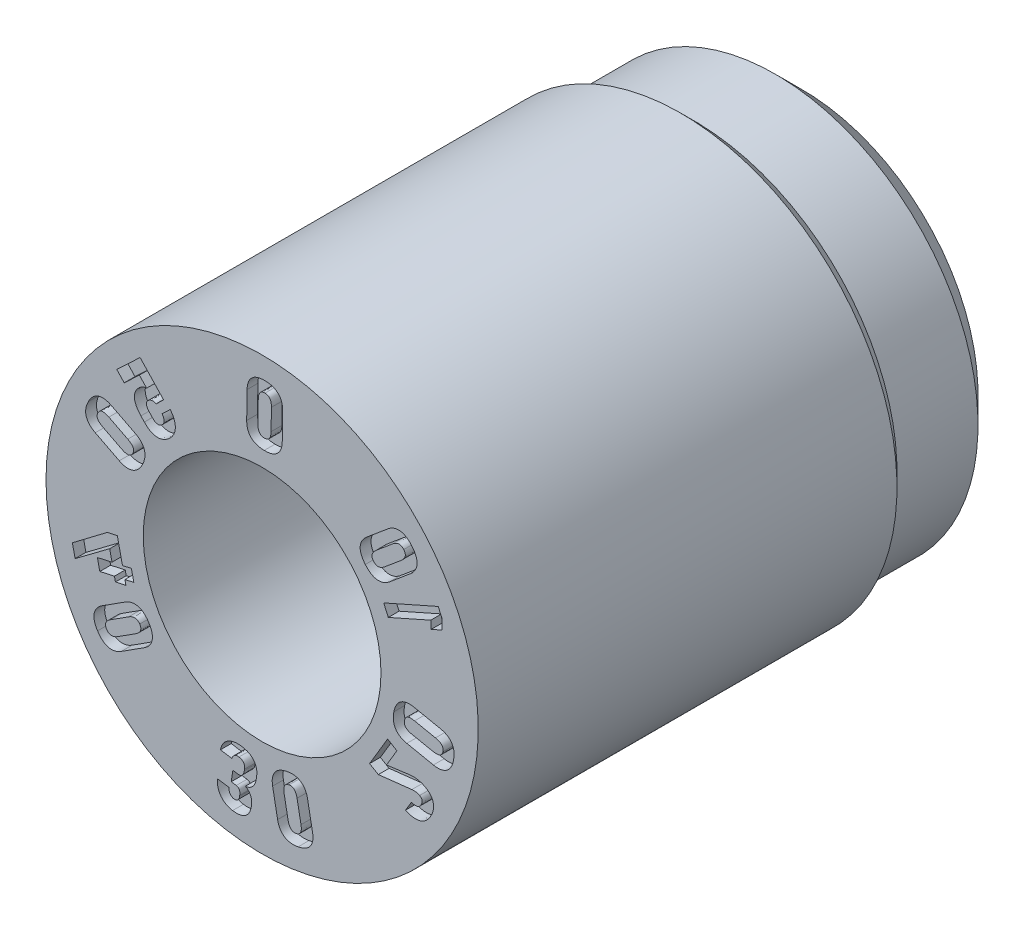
from build123d import *

# Parameters (mm, degrees)
CUT_EXTRUDE1_DEPTH = 0.2


with BuildPart() as part:
    # Sketch2 → Revolve1 (revolve)
    with BuildSketch(Plane(origin=(0, 0, 0), x_dir=(1, 0, 0), z_dir=(0, 1, 0)), mode=Mode.PRIVATE) as revolve1_sk:
        Polygon((3.249621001, 10), (1.15, 10), (1.15, 7.468), (2.2, 7.468), (2.2, 0), (4, 0), (4, 7.75), (3.75, 8), (3.75, 9.499621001), align=None)
    revolve(revolve1_sk.sketch.rotate(Axis((0, 0, -4.849143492), (0, 0, 1)), 180), axis=Axis((0, 0, -4.849143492), (0, 0, 1)))

    # Sketch7 → Cut-Extrude1 (cut)
    # profile 1 of 11: a face of its own
    with BuildSketch(Plane.XY):
        with BuildLine():
            Line((0.372515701, 2.796139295), (0.380015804, 3.296266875))
            add(Edge.make_bspline(
                [(0.380015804, 3.296266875), (0.38043238, 3.319673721), (0.378773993, 3.354103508), (0.370234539, 3.398086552), (0.361653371, 3.428335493), (0.350089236, 3.456399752), (0.336011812, 3.482461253), (0.319112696, 3.506441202), (0.299609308, 3.528409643), (0.277402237, 3.547964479), (0.252928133, 3.565185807), (0.225938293, 3.579864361), (0.196404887, 3.591530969), (0.164622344, 3.601183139), (0.117629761, 3.61036973), (0.080835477, 3.61346309), (0.055588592, 3.613705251)],
                knots=[0, 0, 0, 0, 0.135916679, 0.199020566, 0.259617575, 0.318028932, 0.374760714, 0.431118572, 0.487850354, 0.544800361, 0.602395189, 0.661140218, 0.722587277, 0.786313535, 0.853593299, 1, 1, 1, 1], degree=3))
            add(Edge.make_bspline(
                [(0.055588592, 3.613705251), (0.030232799, 3.614238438), (-0.006797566, 3.612489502), (-0.054133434, 3.604485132), (-0.08621242, 3.595998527), (-0.116076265, 3.585211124), (-0.143392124, 3.571228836), (-0.168487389, 3.555046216), (-0.190946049, 3.536019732), (-0.210915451, 3.514755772), (-0.228702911, 3.491478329), (-0.243292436, 3.465618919), (-0.255683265, 3.437871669), (-0.265328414, 3.407932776), (-0.274813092, 3.364063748), (-0.278088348, 3.32969752), (-0.278152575, 3.306150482)],
                knots=[0, 0, 0, 0, 0.147071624, 0.214293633, 0.278046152, 0.339282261, 0.398039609, 0.455620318, 0.512083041, 0.56825736, 0.624525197, 0.681520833, 0.740021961, 0.800497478, 0.863558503, 1, 1, 1, 1], degree=3))
            Line((-0.278152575, 3.306150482), (-0.285652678, 2.806022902))
            add(Edge.make_bspline(
                [(-0.285652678, 2.806022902), (-0.286080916, 2.782612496), (-0.284389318, 2.748192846), (-0.27591428, 2.704264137), (-0.267228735, 2.674122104), (-0.255708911, 2.646004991), (-0.24145371, 2.619921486), (-0.224533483, 2.595837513), (-0.205020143, 2.573873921), (-0.182814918, 2.554319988), (-0.158343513, 2.537090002), (-0.131402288, 2.52247991), (-0.101924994, 2.510662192), (-0.070164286, 2.501177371), (-0.023209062, 2.491848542), (0.013536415, 2.488862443), (0.038774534, 2.488584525)],
                knots=[0, 0, 0, 0, 0.135948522, 0.199067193, 0.259265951, 0.317690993, 0.375029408, 0.431400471, 0.488145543, 0.545108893, 0.602717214, 0.661476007, 0.722530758, 0.786690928, 0.853558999, 1, 1, 1, 1], degree=3))
            add(Edge.make_bspline(
                [(0.038774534, 2.488584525), (0.064106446, 2.488176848), (0.101219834, 2.489570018), (0.148467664, 2.498119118), (0.180641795, 2.506430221), (0.210492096, 2.51762388), (0.237955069, 2.531575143), (0.262920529, 2.548301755), (0.285555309, 2.567311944), (0.305591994, 2.588803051), (0.322963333, 2.612494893), (0.338056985, 2.6380916), (0.349965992, 2.665998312), (0.359732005, 2.695615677), (0.369198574, 2.738973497), (0.372433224, 2.772889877), (0.372515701, 2.796139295)],
                knots=[0, 0, 0, 0, 0.147244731, 0.214633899, 0.278461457, 0.339933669, 0.39934914, 0.456893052, 0.514034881, 0.570600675, 0.627041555, 0.684310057, 0.742717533, 0.802847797, 0.86513064, 1, 1, 1, 1], degree=3))
        make_face()
        with BuildLine():
            Line((-0.077556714, 2.856153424), (-0.071516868, 3.250243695))
            add(Edge.make_bspline(
                [(-0.071516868, 3.250243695), (-0.071427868, 3.274045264), (-0.068011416, 3.307957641), (-0.054694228, 3.348731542), (-0.043327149, 3.369060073), (-0.032461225, 3.382612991), (-0.023515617, 3.391421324), (-0.013166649, 3.398505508), (-0.00207849, 3.404541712), (0.010216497, 3.408806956), (0.028313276, 3.413277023), (0.042761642, 3.414097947), (0.052598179, 3.413967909)],
                knots=[0, 0, 0, 0, 0.305303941, 0.432512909, 0.54730289, 0.60130705, 0.654799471, 0.707462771, 0.761500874, 0.816087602, 0.873697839, 1, 1, 1, 1], degree=3))
            add(Edge.make_bspline(
                [(0.052598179, 3.413967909), (0.062405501, 3.413784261), (0.076827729, 3.412488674), (0.094807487, 3.407526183), (0.107077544, 3.403092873), (0.117829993, 3.396444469), (0.127850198, 3.388975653), (0.136830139, 3.38013654), (0.147414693, 3.366233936), (0.157914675, 3.345425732), (0.170346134, 3.304398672), (0.17207795, 3.270309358), (0.171933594, 3.24658448)],
                knots=[0, 0, 0, 0, 0.125899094, 0.183939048, 0.238731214, 0.292280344, 0.345132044, 0.398638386, 0.453053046, 0.568333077, 0.694858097, 1, 1, 1, 1], degree=3))
            Line((0.171933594, 3.24658448), (0.165893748, 2.852494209))
            add(Edge.make_bspline(
                [(0.165893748, 2.852494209), (0.165895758, 2.8286767), (0.16223851, 2.794828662), (0.149246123, 2.753952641), (0.138055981, 2.733364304), (0.126817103, 2.719970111), (0.117896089, 2.711087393), (0.107540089, 2.703992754), (0.096398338, 2.698028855), (0.084201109, 2.693415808), (0.066029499, 2.689068), (0.051612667, 2.68816147), (0.041764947, 2.688321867)],
                knots=[0, 0, 0, 0, 0.304842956, 0.431582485, 0.547045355, 0.601549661, 0.654961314, 0.707545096, 0.761501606, 0.816365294, 0.873888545, 1, 1, 1, 1], degree=3))
            add(Edge.make_bspline(
                [(0.041764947, 2.688321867), (0.031953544, 2.688509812), (0.017615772, 2.689786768), (-0.000407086, 2.694756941), (-0.012528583, 2.699478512), (-0.023603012, 2.705774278), (-0.033394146, 2.713506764), (-0.042244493, 2.722432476), (-0.052840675, 2.736260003), (-0.063310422, 2.757186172), (-0.076103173, 2.798196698), (-0.077618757, 2.83245604), (-0.077556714, 2.856153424)],
                knots=[0, 0, 0, 0, 0.125783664, 0.182840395, 0.238804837, 0.291849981, 0.345213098, 0.397973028, 0.452337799, 0.567512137, 0.695137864, 1, 1, 1, 1], degree=3))
        make_face(mode=Mode.SUBTRACT)
    # profile 2 of 11: a face of its own
    with BuildSketch(Plane.XY):
        with BuildLine():
            Line((2.361206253, 1.544277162), (2.745359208, 1.865868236))
            add(Edge.make_bspline(
                [(2.745359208, 1.865868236), (2.763356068, 1.880903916), (2.788412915, 1.904583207), (2.816076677, 1.939841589), (2.833229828, 1.966142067), (2.847034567, 1.993202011), (2.857676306, 2.020911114), (2.864482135, 2.0495183), (2.868429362, 2.07867086), (2.869006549, 2.108340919), (2.865775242, 2.138213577), (2.859295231, 2.168295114), (2.849012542, 2.198426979), (2.835507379, 2.228710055), (2.811917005, 2.270383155), (2.790072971, 2.300135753), (2.773782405, 2.319467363)],
                knots=[0, 0, 0, 0, 0.136048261, 0.198821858, 0.259388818, 0.3177557, 0.374583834, 0.430992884, 0.487788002, 0.544820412, 0.602526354, 0.661561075, 0.722810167, 0.786716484, 0.853482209, 1, 1, 1, 1], degree=3))
            add(Edge.make_bspline(
                [(2.773782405, 2.319467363), (2.75749871, 2.338980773), (2.732005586, 2.365983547), (2.69495357, 2.396676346), (2.667683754, 2.415706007), (2.639567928, 2.430657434), (2.611415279, 2.442903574), (2.582534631, 2.450922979), (2.553455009, 2.455752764), (2.524190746, 2.45712116), (2.49491693, 2.455051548), (2.465785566, 2.449421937), (2.436683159, 2.4407025), (2.407712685, 2.428348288), (2.368036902, 2.407155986), (2.340270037, 2.386407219), (2.322138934, 2.371453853)],
                knots=[0, 0, 0, 0, 0.147180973, 0.214193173, 0.278272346, 0.339279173, 0.398254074, 0.455627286, 0.512298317, 0.56858008, 0.624811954, 0.681767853, 0.739995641, 0.800344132, 0.863777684, 1, 1, 1, 1], degree=3))
            Line((2.322138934, 2.371453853), (1.937985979, 2.049862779))
            add(Edge.make_bspline(
                [(1.937985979, 2.049862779), (1.919988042, 2.03482741), (1.894934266, 2.011147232), (1.867265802, 1.975890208), (1.85012499, 1.949586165), (1.836242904, 1.922473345), (1.825742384, 1.894640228), (1.818517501, 1.866057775), (1.814685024, 1.83687409), (1.814048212, 1.807279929), (1.817387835, 1.777488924), (1.823819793, 1.74747328), (1.834126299, 1.717350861), (1.847586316, 1.686988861), (1.871553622, 1.645473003), (1.893188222, 1.615547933), (1.909562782, 1.596263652)],
                knots=[0, 0, 0, 0, 0.136005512, 0.198759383, 0.259307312, 0.317655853, 0.374891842, 0.431311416, 0.488088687, 0.545103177, 0.60237518, 0.661391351, 0.722621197, 0.786507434, 0.853528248, 1, 1, 1, 1], degree=3))
            add(Edge.make_bspline(
                [(1.909562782, 1.596263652), (1.925768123, 1.576822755), (1.95123474, 1.549834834), (1.988396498, 1.519331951), (2.015706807, 1.500266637), (2.043829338, 1.485172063), (2.0722147, 1.473351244), (2.101163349, 1.46510032), (2.130467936, 1.46059458), (2.159916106, 1.459328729), (2.189327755, 1.461764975), (2.218582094, 1.467183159), (2.247633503, 1.475974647), (2.276461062, 1.488122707), (2.31569609, 1.509136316), (2.343383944, 1.529331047), (2.361206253, 1.544277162)],
                knots=[0, 0, 0, 0, 0.146754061, 0.214223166, 0.27837807, 0.339456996, 0.398831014, 0.456272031, 0.513451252, 0.570286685, 0.626693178, 0.684121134, 0.742417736, 0.802238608, 0.865138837, 1, 1, 1, 1], degree=3))
        make_face()
        with BuildLine():
            Line((2.112064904, 1.924752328), (2.414715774, 2.178081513))
            add(Edge.make_bspline(
                [(2.414715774, 2.178081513), (2.433163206, 2.192979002), (2.46061737, 2.213376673), (2.500362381, 2.229753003), (2.527372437, 2.235455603), (2.553390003, 2.234770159), (2.58763726, 2.223905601), (2.608556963, 2.205255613), (2.620425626, 2.191004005)],
                knots=[0, 0, 0, 0, 0.304434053, 0.43191662, 0.54686507, 0.654939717, 0.760865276, 1, 1, 1, 1], degree=3))
            add(Edge.make_bspline(
                [(2.620425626, 2.191004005), (2.626554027, 2.183349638), (2.635234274, 2.171782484), (2.643204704, 2.154831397), (2.647441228, 2.142495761), (2.649817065, 2.130015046), (2.650522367, 2.117559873), (2.649730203, 2.104994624), (2.645894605, 2.087971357), (2.637014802, 2.066352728), (2.614246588, 2.029893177), (2.589279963, 2.006417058), (2.571280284, 1.990978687)],
                knots=[0, 0, 0, 0, 0.125814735, 0.183364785, 0.23896944, 0.292216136, 0.345299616, 0.398176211, 0.452685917, 0.567770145, 0.695197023, 1, 1, 1, 1], degree=3))
            Line((2.571280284, 1.990978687), (2.268629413, 1.737649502))
            add(Edge.make_bspline(
                [(2.268629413, 1.737649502), (2.250153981, 1.722814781), (2.222723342, 1.702210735), (2.182806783, 1.686059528), (2.15583733, 1.680351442), (2.129843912, 1.680887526), (2.095942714, 1.692273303), (2.074827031, 1.710259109), (2.063140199, 1.724687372)],
                knots=[0, 0, 0, 0, 0.304816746, 0.433270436, 0.548363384, 0.655627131, 0.761810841, 1, 1, 1, 1], degree=3))
            add(Edge.make_bspline(
                [(2.063140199, 1.724687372), (2.05692335, 1.732297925), (2.048467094, 1.744024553), (2.040106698, 1.760832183), (2.03589515, 1.773240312), (2.033601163, 1.785737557), (2.032524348, 1.798187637), (2.033414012, 1.810778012), (2.037223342, 1.827794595), (2.046069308, 1.849478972), (2.069273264, 1.885693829), (2.093948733, 1.90938844), (2.112064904, 1.924752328)],
                knots=[0, 0, 0, 0, 0.125670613, 0.183714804, 0.239255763, 0.292441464, 0.34569566, 0.398511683, 0.452958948, 0.567911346, 0.695546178, 1, 1, 1, 1], degree=3))
        make_face(mode=Mode.SUBTRACT)
    # profile 3 of 11: a face of its own
    with BuildSketch(Plane.XY):
        Polygon((2.250753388, 1.150243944), (2.335097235, 0.959973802), (3.12052075, 1.308595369), (3.128650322, 1.165370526), (3.330558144, 1.254913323), (3.331462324, 1.435582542), (3.259492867, 1.598075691), align=None)
    # profile 4 of 11: a face of its own
    with BuildSketch(Plane.XY):
        with BuildLine():
            Line((2.67852513, -0.886818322), (3.169385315, -0.987816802))
            add(Edge.make_bspline(
                [(3.169385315, -0.987816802), (3.192361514, -0.992542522), (3.226528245, -0.997415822), (3.271367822, -0.997006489), (3.302651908, -0.994345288), (3.332459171, -0.988013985), (3.360778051, -0.979003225), (3.387650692, -0.966940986), (3.412766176, -0.951695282), (3.436121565, -0.933639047), (3.457644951, -0.912785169), (3.477109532, -0.889063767), (3.494306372, -0.862311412), (3.509678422, -0.832813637), (3.52754177, -0.788247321), (3.537220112, -0.752500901), (3.542391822, -0.727766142)],
                knots=[0, 0, 0, 0, 0.136056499, 0.198872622, 0.259510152, 0.317640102, 0.375023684, 0.431403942, 0.487870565, 0.544847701, 0.602093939, 0.661145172, 0.722212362, 0.78603048, 0.853579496, 1, 1, 1, 1], degree=3))
            add(Edge.make_bspline(
                [(3.542391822, -0.727766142), (3.547225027, -0.702905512), (3.553026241, -0.666225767), (3.553826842, -0.618150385), (3.551450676, -0.584939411), (3.546111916, -0.553571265), (3.538056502, -0.523902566), (3.526607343, -0.496204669), (3.512175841, -0.470412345), (3.495010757, -0.446680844), (3.475133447, -0.425064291), (3.45261875, -0.405743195), (3.42765231, -0.388333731), (3.399938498, -0.373426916), (3.358559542, -0.355763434), (3.325204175, -0.346388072), (3.302065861, -0.341754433)],
                knots=[0, 0, 0, 0, 0.146740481, 0.214033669, 0.277858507, 0.339150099, 0.39790425, 0.455392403, 0.512130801, 0.568566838, 0.624503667, 0.681668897, 0.739930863, 0.800300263, 0.863434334, 1, 1, 1, 1], degree=3))
            Line((3.302065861, -0.341754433), (2.811205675, -0.240755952))
            add(Edge.make_bspline(
                [(2.811205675, -0.240755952), (2.788227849, -0.236023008), (2.754065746, -0.231170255), (2.709219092, -0.231548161), (2.677892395, -0.234297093), (2.648015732, -0.240347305), (2.619770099, -0.249636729), (2.592930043, -0.261691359), (2.567622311, -0.276712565), (2.544213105, -0.294893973), (2.522672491, -0.315809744), (2.503438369, -0.339777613), (2.486181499, -0.366454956), (2.470857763, -0.395900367), (2.453038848, -0.440399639), (2.443306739, -0.476054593), (2.438199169, -0.500806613)],
                knots=[0, 0, 0, 0, 0.136038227, 0.198845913, 0.259475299, 0.317952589, 0.375002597, 0.431375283, 0.488087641, 0.545057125, 0.602695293, 0.661619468, 0.722678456, 0.786488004, 0.853595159, 1, 1, 1, 1], degree=3))
            add(Edge.make_bspline(
                [(2.438199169, -0.500806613), (2.433165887, -0.52566337), (2.427808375, -0.562428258), (2.427026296, -0.610567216), (2.429106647, -0.643862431), (2.434984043, -0.675232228), (2.443066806, -0.704921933), (2.454980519, -0.7325468), (2.469523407, -0.758407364), (2.486908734, -0.782223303), (2.506954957, -0.803857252), (2.529497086, -0.82324819), (2.55441156, -0.840603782), (2.581974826, -0.855470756), (2.622863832, -0.872938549), (2.655804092, -0.882092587), (2.67852513, -0.886818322)],
                knots=[0, 0, 0, 0, 0.147061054, 0.214441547, 0.278733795, 0.33997953, 0.399081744, 0.456654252, 0.513810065, 0.570691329, 0.627095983, 0.684335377, 0.742672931, 0.802689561, 0.865472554, 1, 1, 1, 1], degree=3))
        make_face()
        with BuildLine():
            Line((2.821247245, -0.455074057), (3.208207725, -0.534440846))
            add(Edge.make_bspline(
                [(3.208207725, -0.534440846), (3.231565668, -0.539073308), (3.26424204, -0.548817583), (3.301960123, -0.569379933), (3.320161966, -0.584202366), (3.331338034, -0.597685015), (3.338246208, -0.608212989), (3.343393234, -0.619652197), (3.347357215, -0.63176666), (3.349198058, -0.644756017), (3.35053118, -0.663433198), (3.348175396, -0.677770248), (3.346512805, -0.687419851)],
                knots=[0, 0, 0, 0, 0.30455264, 0.431243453, 0.546886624, 0.601522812, 0.654465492, 0.70717538, 0.761317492, 0.816657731, 0.874280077, 1, 1, 1, 1], degree=3))
            add(Edge.make_bspline(
                [(3.346512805, -0.687419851), (3.344775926, -0.697145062), (3.340365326, -0.710897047), (3.332173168, -0.727681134), (3.325356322, -0.738841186), (3.316984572, -0.748392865), (3.307729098, -0.756850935), (3.297275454, -0.76392217), (3.281605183, -0.771745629), (3.259103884, -0.778410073), (3.216296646, -0.782819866), (3.182366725, -0.778342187), (3.159049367, -0.773616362)],
                knots=[0, 0, 0, 0, 0.125914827, 0.183234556, 0.238294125, 0.29231041, 0.344822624, 0.398023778, 0.452876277, 0.567959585, 0.695300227, 1, 1, 1, 1], degree=3))
            Line((3.159049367, -0.773616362), (2.772088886, -0.694249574))
            add(Edge.make_bspline(
                [(2.772088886, -0.694249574), (2.748803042, -0.689488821), (2.71592598, -0.680085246), (2.678466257, -0.659046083), (2.66022191, -0.644288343), (2.649042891, -0.630799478), (2.642156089, -0.620266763), (2.636946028, -0.608894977), (2.633308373, -0.596739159), (2.631293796, -0.583856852), (2.630582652, -0.565181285), (2.632008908, -0.5508483), (2.634284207, -0.541241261)],
                knots=[0, 0, 0, 0, 0.304809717, 0.431711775, 0.547452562, 0.602134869, 0.655122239, 0.70787662, 0.761446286, 0.816833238, 0.874083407, 1, 1, 1, 1], degree=3))
            add(Edge.make_bspline(
                [(2.634284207, -0.541241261), (2.636244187, -0.531592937), (2.640135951, -0.517647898), (2.648432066, -0.500895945), (2.655233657, -0.489734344), (2.66359703, -0.48016508), (2.672869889, -0.471803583), (2.68310405, -0.464483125), (2.698806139, -0.45678673), (2.721288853, -0.44995096), (2.764151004, -0.446342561), (2.797975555, -0.450056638), (2.821247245, -0.455074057)],
                knots=[0, 0, 0, 0, 0.126090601, 0.183466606, 0.238580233, 0.29264955, 0.34521332, 0.397958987, 0.452865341, 0.568061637, 0.695891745, 1, 1, 1, 1], degree=3))
        make_face(mode=Mode.SUBTRACT)
    # profile 5 of 11: a face of its own
    with BuildSketch(Plane.XY):
        with BuildLine():
            Line((2.150270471, -1.651452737), (2.771374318, -1.580727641))
            add(Edge.make_bspline(
                [(2.771374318, -1.580727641), (2.797639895, -1.577981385), (2.830909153, -1.577088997), (2.868576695, -1.585027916), (2.890290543, -1.591014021), (2.905113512, -1.598149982), (2.914334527, -1.603290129)],
                knots=[0, 0, 0, 0, 0.541423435, 0.666875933, 0.784327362, 1, 1, 1, 1], degree=3))
            Line((2.914334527, -1.603290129), (2.915763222, -1.604046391))
            add(Edge.make_bspline(
                [(2.915763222, -1.604046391), (2.927172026, -1.611017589), (2.94292426, -1.623515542), (2.955889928, -1.645974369), (2.960880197, -1.664049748), (2.961661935, -1.683512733), (2.957185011, -1.712466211), (2.947134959, -1.733335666), (2.939037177, -1.746929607)],
                knots=[0, 0, 0, 0, 0.245917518, 0.356468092, 0.468349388, 0.584908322, 0.709615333, 1, 1, 1, 1], degree=3))
            add(Edge.make_bspline(
                [(2.939037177, -1.746929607), (2.931047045, -1.760662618), (2.915610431, -1.778705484), (2.88919661, -1.795107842), (2.867273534, -1.801908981), (2.84363806, -1.805060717), (2.808441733, -1.80203604), (2.782306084, -1.793405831), (2.765151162, -1.785448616)],
                knots=[0, 0, 0, 0, 0.240841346, 0.353251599, 0.467359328, 0.586554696, 0.713016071, 1, 1, 1, 1], degree=3))
            Line((2.765151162, -1.785448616), (2.655504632, -1.968134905))
            add(Edge.make_bspline(
                [(2.655504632, -1.968134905), (2.684973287, -1.98364356), (2.729457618, -2.000842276), (2.790101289, -2.014189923), (2.833613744, -2.01736822), (2.875748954, -2.01543858), (2.916305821, -2.008062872), (2.954944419, -1.994855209), (2.991431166, -1.976017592), (3.025580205, -1.952153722), (3.068503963, -1.912671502), (3.094795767, -1.876541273), (3.110400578, -1.850723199)],
                knots=[0, 0, 0, 0, 0.185650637, 0.271494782, 0.354397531, 0.434528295, 0.512277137, 0.589458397, 0.667295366, 0.74647942, 0.827159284, 1, 1, 1, 1], degree=3))
            add(Edge.make_bspline(
                [(3.110400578, -1.850723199), (3.126791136, -1.823116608), (3.147789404, -1.781143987), (3.165123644, -1.723209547), (3.172456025, -1.682534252), (3.174213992, -1.643098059), (3.169928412, -1.605297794), (3.160279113, -1.569196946), (3.145102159, -1.535016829), (3.12440526, -1.502944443), (3.088143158, -1.462688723), (3.054623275, -1.437813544), (3.030287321, -1.423308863)],
                knots=[0, 0, 0, 0, 0.195290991, 0.283253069, 0.36663673, 0.445822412, 0.522204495, 0.596865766, 0.672008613, 0.748509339, 0.827797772, 1, 1, 1, 1], degree=3))
            add(Edge.make_bspline(
                [(3.030287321, -1.423308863), (3.008017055, -1.410106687), (2.973873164, -1.393616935), (2.925746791, -1.377587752), (2.888269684, -1.368337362), (2.849994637, -1.36249469), (2.799019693, -1.358451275), (2.760772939, -1.360082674), (2.735668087, -1.363519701)],
                knots=[0, 0, 0, 0, 0.246410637, 0.371095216, 0.497940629, 0.625271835, 0.751146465, 1, 1, 1, 1], degree=3))
            Line((2.735668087, -1.363519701), (2.302120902, -1.421463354))
            Line((2.302120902, -1.421463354), (2.494866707, -1.097471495))
            Line((2.494866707, -1.097471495), (2.322944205, -0.994999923))
            Line((2.322944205, -0.994999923), (1.989292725, -1.555548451))
            Line((1.989292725, -1.555548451), (2.150270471, -1.651452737))
        make_face()
    # profile 6 of 11: a face of its own
    with BuildSketch(Plane.XY):
        with BuildLine():
            Line((0.194455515, -2.814011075), (0.286590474, -3.305068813))
            add(Edge.make_bspline(
                [(0.286590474, -3.305068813), (0.290917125, -3.328067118), (0.299542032, -3.361324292), (0.3161785, -3.402801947), (0.330852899, -3.430450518), (0.34769362, -3.455651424), (0.366626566, -3.47840697), (0.387918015, -3.49860752), (0.411413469, -3.516159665), (0.4369537, -3.531034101), (0.464426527, -3.542809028), (0.49363775, -3.55178016), (0.524788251, -3.557662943), (0.557856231, -3.560691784), (0.605750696, -3.560265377), (0.642375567, -3.555746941), (0.667139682, -3.551134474)],
                knots=[0, 0, 0, 0, 0.135991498, 0.198956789, 0.259278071, 0.317535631, 0.374792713, 0.430927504, 0.487676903, 0.544841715, 0.60225663, 0.660981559, 0.722057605, 0.786137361, 0.853628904, 1, 1, 1, 1], degree=3))
            add(Edge.make_bspline(
                [(0.667139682, -3.551134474), (0.692083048, -3.546742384), (0.727815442, -3.537256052), (0.772726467, -3.52040829), (0.802432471, -3.505667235), (0.829351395, -3.488912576), (0.853572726, -3.470136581), (0.874712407, -3.449007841), (0.893243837, -3.426109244), (0.908584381, -3.401254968), (0.920988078, -3.374774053), (0.930763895, -3.346855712), (0.936965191, -3.317120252), (0.94030369, -3.28592349), (0.941536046, -3.24102922), (0.93681143, -3.206776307), (0.932746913, -3.183650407)],
                knots=[0, 0, 0, 0, 0.146861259, 0.214086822, 0.278090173, 0.338994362, 0.397858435, 0.455547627, 0.512085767, 0.568467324, 0.624609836, 0.681530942, 0.739750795, 0.800470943, 0.863458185, 1, 1, 1, 1], degree=3))
            Line((0.932746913, -3.183650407), (0.840611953, -2.692592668))
            add(Edge.make_bspline(
                [(0.840611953, -2.692592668), (0.836174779, -2.66963974), (0.827864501, -2.636252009), (0.810745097, -2.594971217), (0.796158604, -2.56728515), (0.779295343, -2.542093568), (0.760368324, -2.519335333), (0.739075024, -2.499136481), (0.715581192, -2.481580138), (0.690036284, -2.466720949), (0.662526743, -2.45486524), (0.633188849, -2.446109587), (0.60200109, -2.440140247), (0.568996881, -2.437168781), (0.521174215, -2.437397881), (0.484617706, -2.442044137), (0.459853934, -2.446608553)],
                knots=[0, 0, 0, 0, 0.135999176, 0.198975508, 0.259300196, 0.317561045, 0.374821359, 0.43095932, 0.487711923, 0.544879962, 0.602298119, 0.661367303, 0.722446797, 0.786530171, 0.85362064, 1, 1, 1, 1], degree=3))
            add(Edge.make_bspline(
                [(0.459853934, -2.446608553), (0.434956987, -2.451117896), (0.399020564, -2.460290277), (0.354243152, -2.477679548), (0.324385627, -2.492302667), (0.297574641, -2.509333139), (0.273536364, -2.52836371), (0.252153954, -2.549404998), (0.234035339, -2.572795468), (0.218653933, -2.597811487), (0.206439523, -2.624487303), (0.196555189, -2.65242206), (0.190510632, -2.682046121), (0.186723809, -2.71303838), (0.186195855, -2.757414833), (0.190084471, -2.791273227), (0.194455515, -2.814011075)],
                knots=[0, 0, 0, 0, 0.147080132, 0.214838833, 0.27893757, 0.340014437, 0.399092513, 0.45686768, 0.513928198, 0.570655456, 0.62718115, 0.684187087, 0.742493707, 0.802536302, 0.86545121, 1, 1, 1, 1], degree=3))
        make_face()
        with BuildLine():
            Line((0.6467972, -2.782960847), (0.719470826, -3.169953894))
            add(Edge.make_bspline(
                [(0.719470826, -3.169953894), (0.723455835, -3.19325713), (0.727664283, -3.227144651), (0.722463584, -3.269682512), (0.715627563, -3.292044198), (0.707428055, -3.307387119), (0.700363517, -3.317773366), (0.691775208, -3.326961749), (0.681825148, -3.334801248), (0.67089071, -3.341862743), (0.653944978, -3.349684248), (0.640018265, -3.353444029), (0.6303235, -3.355177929)],
                knots=[0, 0, 0, 0, 0.304250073, 0.431921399, 0.546901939, 0.601209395, 0.654313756, 0.707409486, 0.761607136, 0.816242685, 0.873810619, 1, 1, 1, 1], degree=3))
            add(Edge.make_bspline(
                [(0.6303235, -3.355177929), (0.620682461, -3.356702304), (0.606322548, -3.358651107), (0.587706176, -3.35720312), (0.574798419, -3.355119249), (0.562878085, -3.350896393), (0.551449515, -3.345750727), (0.541073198, -3.338641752), (0.52794621, -3.327134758), (0.513421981, -3.308824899), (0.493062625, -3.27107371), (0.484922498, -3.237922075), (0.480196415, -3.214782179)],
                knots=[0, 0, 0, 0, 0.125555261, 0.18379268, 0.238793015, 0.292478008, 0.345293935, 0.398936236, 0.452885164, 0.568530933, 0.695936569, 1, 1, 1, 1], degree=3))
            Line((0.480196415, -3.214782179), (0.40752279, -2.827789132))
            add(Edge.make_bspline(
                [(0.40752279, -2.827789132), (0.403098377, -2.804528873), (0.399305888, -2.770652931), (0.404647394, -2.728210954), (0.41144512, -2.705906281), (0.419648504, -2.690566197), (0.426707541, -2.68017327), (0.435266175, -2.671061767), (0.445134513, -2.663115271), (0.456132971, -2.656142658), (0.473118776, -2.648250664), (0.487063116, -2.644517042), (0.49675166, -2.642773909)],
                knots=[0, 0, 0, 0, 0.304571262, 0.431493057, 0.546554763, 0.600900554, 0.654042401, 0.707175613, 0.760498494, 0.816112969, 0.873721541, 1, 1, 1, 1], degree=3))
            add(Edge.make_bspline(
                [(0.49675166, -2.642773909), (0.506366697, -2.640604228), (0.520691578, -2.639674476), (0.539382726, -2.640367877), (0.552150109, -2.642977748), (0.564265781, -2.64673918), (0.575462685, -2.652262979), (0.586080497, -2.659093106), (0.598936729, -2.67083236), (0.613734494, -2.688872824), (0.633373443, -2.726958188), (0.642474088, -2.759632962), (0.6467972, -2.782960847)],
                knots=[0, 0, 0, 0, 0.125734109, 0.18360948, 0.239154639, 0.29226745, 0.34581904, 0.398715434, 0.453553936, 0.568369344, 0.695745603, 1, 1, 1, 1], degree=3))
        make_face(mode=Mode.SUBTRACT)
    # profile 7 of 11: a face of its own
    with BuildSketch(Plane.XY):
        with BuildLine():
            Line((-0.77214876, -2.715853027), (-0.560033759, -2.748025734))
            add(Edge.make_bspline(
                [(-0.560033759, -2.748025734), (-0.557047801, -2.737641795), (-0.551287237, -2.722816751), (-0.540672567, -2.705088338), (-0.531668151, -2.693741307), (-0.521744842, -2.683805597), (-0.510905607, -2.675452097), (-0.499198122, -2.66851076), (-0.486541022, -2.663392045), (-0.473211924, -2.6597704), (-0.454045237, -2.657246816), (-0.43929156, -2.658306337), (-0.429350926, -2.659663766)],
                knots=[0, 0, 0, 0, 0.186011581, 0.27211605, 0.354769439, 0.434747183, 0.513252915, 0.589741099, 0.668299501, 0.747518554, 0.826935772, 1, 1, 1, 1], degree=3))
            add(Edge.make_bspline(
                [(-0.429350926, -2.659663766), (-0.411815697, -2.662198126), (-0.386647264, -2.669388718), (-0.35888117, -2.688254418), (-0.343055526, -2.70552263), (-0.331853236, -2.726156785), (-0.322290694, -2.758592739), (-0.323595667, -2.785079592), (-0.326074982, -2.802752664)],
                knots=[0, 0, 0, 0, 0.265926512, 0.382937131, 0.498140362, 0.612756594, 0.731167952, 1, 1, 1, 1], degree=3))
            Line((-0.326074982, -2.802752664), (-0.329839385, -2.828349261))
            add(Edge.make_bspline(
                [(-0.329839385, -2.828349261), (-0.332282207, -2.846973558), (-0.339468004, -2.872928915), (-0.355048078, -2.90347224), (-0.369512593, -2.920706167), (-0.386289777, -2.933794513), (-0.412812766, -2.944699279), (-0.434798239, -2.945322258), (-0.449241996, -2.943012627)],
                knots=[0, 0, 0, 0, 0.30006281, 0.427974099, 0.545985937, 0.657554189, 0.765422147, 1, 1, 1, 1], degree=3))
            Line((-0.449241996, -2.943012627), (-0.541397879, -2.929035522))
            Line((-0.541397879, -2.929035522), (-0.571434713, -3.126787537))
            Line((-0.571434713, -3.126787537), (-0.479278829, -3.140764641))
            add(Edge.make_bspline(
                [(-0.479278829, -3.140764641), (-0.467588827, -3.14271318), (-0.450094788, -3.14832607), (-0.432497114, -3.164520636), (-0.422554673, -3.179646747), (-0.415570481, -3.197575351), (-0.410833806, -3.226619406), (-0.412278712, -3.249740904), (-0.414708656, -3.265663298)],
                knots=[0, 0, 0, 0, 0.226394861, 0.333881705, 0.446441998, 0.566064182, 0.695006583, 1, 1, 1, 1], degree=3))
            Line((-0.414708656, -3.265663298), (-0.41747193, -3.284292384))
            add(Edge.make_bspline(
                [(-0.41747193, -3.284292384), (-0.420151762, -3.29912409), (-0.425054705, -3.320830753), (-0.439680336, -3.344821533), (-0.452139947, -3.358946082), (-0.467401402, -3.369026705), (-0.491007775, -3.377911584), (-0.510652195, -3.377705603), (-0.523494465, -3.37565675)],
                knots=[0, 0, 0, 0, 0.287275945, 0.410871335, 0.527703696, 0.640138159, 0.752802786, 1, 1, 1, 1], degree=3))
            add(Edge.make_bspline(
                [(-0.523494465, -3.37565675), (-0.532385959, -3.374278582), (-0.545357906, -3.370479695), (-0.561265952, -3.362090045), (-0.572091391, -3.353893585), (-0.582069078, -3.344299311), (-0.590520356, -3.332909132), (-0.598308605, -3.320495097), (-0.604333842, -3.306339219), (-0.609825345, -3.291178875), (-0.614823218, -3.268281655), (-0.616786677, -3.25036429), (-0.616953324, -3.237981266)],
                knots=[0, 0, 0, 0, 0.148489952, 0.221368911, 0.295942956, 0.372134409, 0.449200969, 0.529682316, 0.613648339, 0.702782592, 0.795733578, 1, 1, 1, 1], degree=3))
            Line((-0.616953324, -3.237981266), (-0.828359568, -3.205795))
            add(Edge.make_bspline(
                [(-0.828359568, -3.205795), (-0.830386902, -3.237685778), (-0.828716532, -3.284845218), (-0.816100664, -3.344983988), (-0.801805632, -3.386037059), (-0.782955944, -3.42379765), (-0.759897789, -3.45802101), (-0.732562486, -3.488341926), (-0.701462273, -3.514742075), (-0.66692335, -3.537090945), (-0.616034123, -3.561213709), (-0.574508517, -3.571793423), (-0.546175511, -3.576175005)],
                knots=[0, 0, 0, 0, 0.185618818, 0.272300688, 0.356075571, 0.437425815, 0.516806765, 0.595044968, 0.673812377, 0.753112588, 0.83334344, 1, 1, 1, 1], degree=3))
            add(Edge.make_bspline(
                [(-0.546175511, -3.576175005), (-0.523388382, -3.579708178), (-0.48968513, -3.582684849), (-0.445805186, -3.58146305), (-0.415418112, -3.577615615), (-0.386757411, -3.571445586), (-0.359666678, -3.562596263), (-0.334443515, -3.550927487), (-0.310882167, -3.536874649), (-0.289337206, -3.520182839), (-0.270032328, -3.500999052), (-0.252606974, -3.479727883), (-0.237856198, -3.455883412), (-0.224619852, -3.430101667), (-0.210681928, -3.39112102), (-0.203110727, -3.36027349), (-0.200108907, -3.338769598)],
                knots=[0, 0, 0, 0, 0.144886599, 0.212006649, 0.275464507, 0.337082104, 0.3959775, 0.454157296, 0.511360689, 0.568021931, 0.624947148, 0.682057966, 0.740372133, 0.800813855, 0.863818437, 1, 1, 1, 1], degree=3))
            Line((-0.200108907, -3.338769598), (-0.19520976, -3.305777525))
            add(Edge.make_bspline(
                [(-0.19520976, -3.305777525), (-0.19176529, -3.281886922), (-0.190343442, -3.24580374), (-0.200283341, -3.199719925), (-0.212483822, -3.167717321), (-0.229721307, -3.138038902), (-0.259425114, -3.10127315), (-0.288681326, -3.07993875), (-0.309449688, -3.067677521)],
                knots=[0, 0, 0, 0, 0.257469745, 0.378865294, 0.499432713, 0.620408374, 0.742569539, 1, 1, 1, 1], degree=3))
            add(Edge.make_bspline(
                [(-0.309449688, -3.067677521), (-0.296317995, -3.066731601), (-0.276931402, -3.063966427), (-0.252380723, -3.056153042), (-0.235102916, -3.048890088), (-0.218601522, -3.040113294), (-0.203061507, -3.029607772), (-0.188476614, -3.017445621), (-0.174832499, -3.003769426), (-0.161988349, -2.988780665), (-0.150962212, -2.971933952), (-0.140219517, -2.954373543), (-0.131434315, -2.935137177), (-0.123216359, -2.914809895), (-0.114669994, -2.885020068), (-0.109081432, -2.861986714), (-0.10708343, -2.845996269)],
                knots=[0, 0, 0, 0, 0.12097921, 0.178629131, 0.236062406, 0.292807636, 0.349899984, 0.407924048, 0.466829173, 0.527080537, 0.58870217, 0.651420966, 0.715827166, 0.782529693, 0.852491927, 1, 1, 1, 1], degree=3))
            Line((-0.10708343, -2.845996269), (-0.101970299, -2.813071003))
            add(Edge.make_bspline(
                [(-0.101970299, -2.813071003), (-0.097714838, -2.783421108), (-0.09461304, -2.739408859), (-0.102766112, -2.682953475), (-0.113684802, -2.644674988), (-0.129690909, -2.609279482), (-0.151286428, -2.577462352), (-0.177378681, -2.548820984), (-0.20865296, -2.524115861), (-0.244338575, -2.502885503), (-0.299664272, -2.478939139), (-0.345212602, -2.468624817), (-0.376660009, -2.463818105)],
                knots=[0, 0, 0, 0, 0.178256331, 0.259418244, 0.337555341, 0.413897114, 0.489005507, 0.564947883, 0.643052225, 0.724726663, 0.810858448, 1, 1, 1, 1], degree=3))
            add(Edge.make_bspline(
                [(-0.376660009, -2.463818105), (-0.408010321, -2.459112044), (-0.454748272, -2.456040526), (-0.515637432, -2.462432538), (-0.558063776, -2.472181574), (-0.598033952, -2.486388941), (-0.634713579, -2.505842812), (-0.66813411, -2.52996309), (-0.69782746, -2.558961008), (-0.723767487, -2.592040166), (-0.752982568, -2.643019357), (-0.766086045, -2.68612222), (-0.77214876, -2.715853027)],
                knots=[0, 0, 0, 0, 0.181493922, 0.26632587, 0.349485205, 0.430040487, 0.508345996, 0.586248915, 0.665074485, 0.745043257, 0.826062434, 1, 1, 1, 1], degree=3))
        make_face()
    # profile 8 of 11: a face of its own
    with BuildSketch(Plane.XY):
        with BuildLine():
            Line((-2.538435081, -1.230671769), (-2.959800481, -1.500238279))
            add(Edge.make_bspline(
                [(-2.959800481, -1.500238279), (-2.979658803, -1.51269291), (-3.007022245, -1.533443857), (-3.039248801, -1.564389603), (-3.059502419, -1.588288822), (-3.076650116, -1.613394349), (-3.090460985, -1.639723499), (-3.10150004, -1.666960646), (-3.108806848, -1.695399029), (-3.112881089, -1.724629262), (-3.113863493, -1.754600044), (-3.111040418, -1.785114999), (-3.104511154, -1.816199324), (-3.095099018, -1.847999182), (-3.076920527, -1.892312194), (-3.058960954, -1.924510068), (-3.045352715, -1.945699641)],
                knots=[0, 0, 0, 0, 0.135987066, 0.198749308, 0.259058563, 0.317542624, 0.37488926, 0.431369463, 0.487789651, 0.544884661, 0.602419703, 0.661504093, 0.722330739, 0.786569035, 0.853785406, 1, 1, 1, 1], degree=3))
            add(Edge.make_bspline(
                [(-3.045352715, -1.945699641), (-3.031598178, -1.966945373), (-3.010024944, -1.997091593), (-2.977144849, -2.03207507), (-2.95243957, -2.054216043), (-2.926951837, -2.073113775), (-2.900347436, -2.088330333), (-2.873007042, -2.100406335), (-2.844676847, -2.108567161), (-2.815966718, -2.11388511), (-2.786701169, -2.11527047), (-2.757107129, -2.113525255), (-2.727111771, -2.108609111), (-2.696893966, -2.100094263), (-2.65507723, -2.083910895), (-2.624827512, -2.067262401), (-2.604989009, -2.054578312)],
                knots=[0, 0, 0, 0, 0.146936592, 0.214226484, 0.278122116, 0.339157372, 0.397904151, 0.455567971, 0.51208656, 0.568543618, 0.624564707, 0.681576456, 0.740244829, 0.800518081, 0.863356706, 1, 1, 1, 1], degree=3))
            Line((-2.604989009, -2.054578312), (-2.183623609, -1.785011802))
            add(Edge.make_bspline(
                [(-2.183623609, -1.785011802), (-2.163901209, -1.772345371), (-2.136059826, -1.752000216), (-2.103952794, -1.720771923), (-2.083616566, -1.696860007), (-2.066478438, -1.671744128), (-2.052664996, -1.645417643), (-2.041626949, -1.61817987), (-2.034318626, -1.589741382), (-2.030249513, -1.560512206), (-2.02924777, -1.530537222), (-2.032151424, -1.499978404), (-2.038396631, -1.468827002), (-2.048104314, -1.437102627), (-2.066241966, -1.392805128), (-2.083909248, -1.360392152), (-2.097679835, -1.339237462)],
                knots=[0, 0, 0, 0, 0.136055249, 0.199166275, 0.259421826, 0.317853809, 0.375149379, 0.431579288, 0.487949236, 0.544993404, 0.602477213, 0.66150899, 0.722631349, 0.786488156, 0.853644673, 1, 1, 1, 1], degree=3))
            add(Edge.make_bspline(
                [(-2.097679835, -1.339237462), (-2.111286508, -1.317923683), (-2.133164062, -1.28795349), (-2.166158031, -1.253047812), (-2.190883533, -1.230725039), (-2.216699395, -1.212047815), (-2.243517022, -1.196954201), (-2.271097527, -1.18504237), (-2.299574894, -1.177007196), (-2.32852867, -1.171904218), (-2.357909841, -1.17064366), (-2.387495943, -1.172365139), (-2.417397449, -1.177192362), (-2.447488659, -1.185621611), (-2.48879789, -1.202044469), (-2.518909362, -1.218059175), (-2.538435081, -1.230671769)],
                knots=[0, 0, 0, 0, 0.146843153, 0.214581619, 0.278520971, 0.339938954, 0.399121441, 0.456836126, 0.513886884, 0.57049402, 0.627117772, 0.68416853, 0.742274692, 0.802589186, 0.865169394, 1, 1, 1, 1], degree=3))
        make_face()
        with BuildLine():
            Line((-2.339882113, -1.638982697), (-2.671840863, -1.851328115))
            add(Edge.make_bspline(
                [(-2.671840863, -1.851328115), (-2.691887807, -1.864050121), (-2.721908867, -1.880360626), (-2.763387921, -1.891704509), (-2.790882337, -1.893942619), (-2.816480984, -1.8896681), (-2.848941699, -1.874755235), (-2.86688284, -1.853249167), (-2.877063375, -1.83800132)],
                knots=[0, 0, 0, 0, 0.305076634, 0.432928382, 0.548608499, 0.655667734, 0.76193641, 1, 1, 1, 1], degree=3))
            add(Edge.make_bspline(
                [(-2.877063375, -1.83800132), (-2.882267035, -1.829646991), (-2.889175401, -1.816945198), (-2.894987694, -1.79920492), (-2.89768979, -1.786509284), (-2.8985881, -1.773880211), (-2.897750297, -1.761377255), (-2.895296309, -1.74906414), (-2.889718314, -1.732576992), (-2.877940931, -1.712424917), (-2.850818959, -1.679195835), (-2.822963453, -1.65922405), (-2.803244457, -1.646157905)],
                knots=[0, 0, 0, 0, 0.126303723, 0.183866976, 0.238616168, 0.292164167, 0.345489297, 0.398650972, 0.452557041, 0.567735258, 0.695181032, 1, 1, 1, 1], degree=3))
            Line((-2.803244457, -1.646157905), (-2.471285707, -1.433812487))
            add(Edge.make_bspline(
                [(-2.471285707, -1.433812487), (-2.451235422, -1.421097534), (-2.421223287, -1.404768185), (-2.37979542, -1.393467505), (-2.352378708, -1.39115615), (-2.326687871, -1.395120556), (-2.294159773, -1.410186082), (-2.276138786, -1.43165121), (-2.265969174, -1.446935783)],
                knots=[0, 0, 0, 0, 0.304963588, 0.432767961, 0.547566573, 0.654838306, 0.762024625, 1, 1, 1, 1], degree=3))
            add(Edge.make_bspline(
                [(-2.265969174, -1.446935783), (-2.260766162, -1.455289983), (-2.253855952, -1.467992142), (-2.248046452, -1.485731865), (-2.245337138, -1.498428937), (-2.244464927, -1.511052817), (-2.245205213, -1.523558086), (-2.248028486, -1.535856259), (-2.25358034, -1.552383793), (-2.265111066, -1.572767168), (-2.292372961, -1.605905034), (-2.320123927, -1.62594038), (-2.339882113, -1.638982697)],
                knots=[0, 0, 0, 0, 0.126219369, 0.183744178, 0.238456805, 0.291969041, 0.345258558, 0.39816903, 0.45299024, 0.568023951, 0.695384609, 1, 1, 1, 1], degree=3))
        make_face(mode=Mode.SUBTRACT)
    # profile 9 of 11: a face of its own
    with BuildSketch(Plane.XY):
        Polygon((-2.865745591, -0.277763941), (-3.511838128, -0.767384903), (-3.461265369, -0.995485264), (-2.821663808, -0.516833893), (-2.778357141, -0.711664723), (-3.04894252, -0.771803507), (-3.004126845, -0.97338598), (-2.733549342, -0.913248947), (-2.71490169, -0.997142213), (-2.520778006, -0.953845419), (-2.53940268, -0.870099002), (-2.374472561, -0.833442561), (-2.419288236, -0.631860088), (-2.584232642, -0.668519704), (-2.680298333, -0.236557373), align=None)
    # profile 10 of 11: a face of its own
    with BuildSketch(Plane.XY):
        with BuildLine():
            Line((-2.345129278, 1.566648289), (-2.789410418, 1.793544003))
            add(Edge.make_bspline(
                [(-2.789410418, 1.793544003), (-2.810209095, 1.804276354), (-2.84185962, 1.817501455), (-2.884839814, 1.829637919), (-2.915652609, 1.835042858), (-2.945900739, 1.837241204), (-2.97543408, 1.835709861), (-3.004372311, 1.831305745), (-3.03260174, 1.823651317), (-3.059877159, 1.812364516), (-3.086216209, 1.798125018), (-3.111126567, 1.780179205), (-3.134699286, 1.759018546), (-3.157344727, 1.734920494), (-3.186096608, 1.696786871), (-3.205275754, 1.665366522), (-3.216448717, 1.642749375)],
                knots=[0, 0, 0, 0, 0.136066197, 0.19884924, 0.259396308, 0.317712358, 0.374848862, 0.431021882, 0.487687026, 0.544501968, 0.602343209, 0.661450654, 0.722598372, 0.78635314, 0.853456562, 1, 1, 1, 1], degree=3))
            add(Edge.make_bspline(
                [(-3.216448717, 1.642749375), (-3.227756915, 1.620202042), (-3.242907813, 1.58644658), (-3.256461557, 1.540475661), (-3.262963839, 1.507936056), (-3.266337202, 1.476412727), (-3.266225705, 1.445866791), (-3.262766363, 1.416282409), (-3.255592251, 1.387814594), (-3.245531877, 1.360412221), (-3.23221714, 1.334361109), (-3.215670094, 1.309864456), (-3.196392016, 1.286475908), (-3.173434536, 1.265046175), (-3.138784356, 1.236600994), (-3.108680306, 1.219546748), (-3.087962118, 1.208668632)],
                knots=[0, 0, 0, 0, 0.146714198, 0.214199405, 0.278111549, 0.339306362, 0.398112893, 0.455260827, 0.511946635, 0.568312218, 0.624567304, 0.681492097, 0.739809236, 0.80028032, 0.86369044, 1, 1, 1, 1], degree=3))
            Line((-3.087962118, 1.208668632), (-2.643680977, 0.981772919))
            add(Edge.make_bspline(
                [(-2.643680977, 0.981772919), (-2.622882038, 0.971048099), (-2.591232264, 0.957801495), (-2.548250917, 0.945697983), (-2.517384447, 0.940196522), (-2.487129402, 0.93831528), (-2.457521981, 0.939524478), (-2.428608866, 0.944181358), (-2.400305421, 0.951780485), (-2.373105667, 0.963066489), (-2.346808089, 0.977222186), (-2.321966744, 0.995141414), (-2.298391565, 1.016297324), (-2.275746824, 1.040396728), (-2.246994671, 1.078529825), (-2.227815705, 1.109950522), (-2.216642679, 1.132567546)],
                knots=[0, 0, 0, 0, 0.136076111, 0.198863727, 0.259415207, 0.318069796, 0.374847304, 0.431411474, 0.488080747, 0.544899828, 0.602314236, 0.661425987, 0.722578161, 0.786337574, 0.853445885, 1, 1, 1, 1], degree=3))
            add(Edge.make_bspline(
                [(-2.216642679, 1.132567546), (-2.205142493, 1.15508168), (-2.190383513, 1.189039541), (-2.176774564, 1.235021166), (-2.170171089, 1.267558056), (-2.167198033, 1.299156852), (-2.167667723, 1.329780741), (-2.171223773, 1.359496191), (-2.178443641, 1.388158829), (-2.188952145, 1.415523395), (-2.202207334, 1.441638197), (-2.218677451, 1.466227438), (-2.238314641, 1.489159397), (-2.260491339, 1.511047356), (-2.295172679, 1.538685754), (-2.324489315, 1.55608723), (-2.345129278, 1.566648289)],
                knots=[0, 0, 0, 0, 0.147164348, 0.214747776, 0.278752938, 0.340073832, 0.399068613, 0.456680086, 0.51385169, 0.570603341, 0.626940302, 0.683947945, 0.742380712, 0.802360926, 0.865023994, 1, 1, 1, 1], degree=3))
        make_face()
        with BuildLine():
            Line((-2.596727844, 1.190020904), (-2.94689528, 1.36887079))
            add(Edge.make_bspline(
                [(-2.94689528, 1.36887079), (-2.967774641, 1.379931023), (-2.997416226, 1.39696037), (-3.027587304, 1.427354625), (-3.041054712, 1.446365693), (-3.048446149, 1.462111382), (-3.052092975, 1.474105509), (-3.053929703, 1.486362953), (-3.054487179, 1.498985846), (-3.052895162, 1.511912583), (-3.04892943, 1.530167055), (-3.043475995, 1.543529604), (-3.038894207, 1.55220884)],
                knots=[0, 0, 0, 0, 0.304981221, 0.432051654, 0.547154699, 0.601878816, 0.654644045, 0.707391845, 0.760582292, 0.816247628, 0.873980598, 1, 1, 1, 1], degree=3))
            add(Edge.make_bspline(
                [(-3.038894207, 1.55220884), (-3.034279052, 1.560860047), (-3.02700559, 1.573281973), (-3.014666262, 1.587195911), (-3.005118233, 1.59594245), (-2.994556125, 1.602957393), (-2.983381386, 1.608585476), (-2.971538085, 1.612779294), (-2.954436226, 1.615839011), (-2.931163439, 1.616298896), (-2.888910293, 1.60912066), (-2.857520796, 1.595954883), (-2.836363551, 1.585296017)],
                knots=[0, 0, 0, 0, 0.126205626, 0.183208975, 0.238175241, 0.29191471, 0.345362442, 0.398456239, 0.452511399, 0.567693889, 0.695182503, 1, 1, 1, 1], degree=3))
            Line((-2.836363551, 1.585296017), (-2.486196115, 1.406446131))
            add(Edge.make_bspline(
                [(-2.486196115, 1.406446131), (-2.465086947, 1.395697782), (-2.436056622, 1.377959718), (-2.405452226, 1.348032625), (-2.392044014, 1.328944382), (-2.384642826, 1.313206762), (-2.381003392, 1.301211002), (-2.379128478, 1.288851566), (-2.378673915, 1.276226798), (-2.380201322, 1.263300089), (-2.384174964, 1.2451506), (-2.389608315, 1.231786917), (-2.394197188, 1.223108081)],
                knots=[0, 0, 0, 0, 0.304740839, 0.431980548, 0.547102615, 0.601835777, 0.654609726, 0.707366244, 0.761897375, 0.81621726, 0.873959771, 1, 1, 1, 1], degree=3))
            add(Edge.make_bspline(
                [(-2.394197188, 1.223108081), (-2.39881115, 1.214455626), (-2.406087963, 1.202037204), (-2.418471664, 1.188062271), (-2.428040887, 1.179337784), (-2.438600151, 1.172323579), (-2.449710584, 1.166731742), (-2.461552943, 1.162538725), (-2.478656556, 1.159470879), (-2.501969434, 1.159081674), (-2.544318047, 1.165797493), (-2.575532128, 1.179679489), (-2.596727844, 1.190020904)],
                knots=[0, 0, 0, 0, 0.126192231, 0.183189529, 0.239103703, 0.29187917, 0.345321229, 0.398409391, 0.452458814, 0.567629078, 0.695784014, 1, 1, 1, 1], degree=3))
        make_face(mode=Mode.SUBTRACT)
    # profile 11 of 11: a face of its own
    with BuildSketch(Plane.XY):
        with BuildLine():
            Line((-1.700988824, 2.273795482), (-1.852905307, 2.131189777))
            add(Edge.make_bspline(
                [(-1.852905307, 2.131189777), (-1.841103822, 2.116206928), (-1.826962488, 2.093088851), (-1.816455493, 2.059965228), (-1.813937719, 2.036512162), (-1.81618196, 2.013885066), (-1.825164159, 1.984687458), (-1.839904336, 1.96637111), (-1.850919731, 1.955690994)],
                knots=[0, 0, 0, 0, 0.287402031, 0.412847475, 0.533158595, 0.648498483, 0.761423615, 1, 1, 1, 1], degree=3))
            add(Edge.make_bspline(
                [(-1.850919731, 1.955690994), (-1.862806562, 1.944404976), (-1.883082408, 1.930202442), (-1.914077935, 1.922832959), (-1.937235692, 1.922822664), (-1.960608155, 1.928537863), (-1.993306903, 1.94372685), (-2.014472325, 1.962769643), (-2.027979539, 1.976702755)],
                knots=[0, 0, 0, 0, 0.244799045, 0.356012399, 0.468216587, 0.585264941, 0.71026987, 1, 1, 1, 1], degree=3))
            Line((-2.027979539, 1.976702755), (-2.091583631, 2.044234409))
            add(Edge.make_bspline(
                [(-2.091583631, 2.044234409), (-2.104739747, 2.058514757), (-2.122548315, 2.080343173), (-2.136989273, 2.112888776), (-2.141893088, 2.135509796), (-2.141979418, 2.157348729), (-2.134565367, 2.185510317), (-2.121430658, 2.203601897), (-2.110551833, 2.213550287)],
                knots=[0, 0, 0, 0, 0.303817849, 0.432954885, 0.551311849, 0.662077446, 0.770085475, 1, 1, 1, 1], degree=3))
            add(Edge.make_bspline(
                [(-2.110551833, 2.213550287), (-2.100270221, 2.223033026), (-2.083611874, 2.235894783), (-2.058180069, 2.245631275), (-2.039197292, 2.250105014), (-2.019886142, 2.250988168), (-1.993830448, 2.247480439), (-1.975125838, 2.240206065), (-1.963653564, 2.233168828)],
                knots=[0, 0, 0, 0, 0.26393469, 0.387545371, 0.508713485, 0.62858425, 0.748085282, 1, 1, 1, 1], degree=3))
            Line((-1.963653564, 2.233168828), (-1.821927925, 2.366720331))
            Line((-1.821927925, 2.366720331), (-2.258102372, 2.829251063))
            Line((-2.258102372, 2.829251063), (-2.690415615, 2.42183211))
            Line((-2.690415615, 2.42183211), (-2.552626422, 2.275814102))
            Line((-2.552626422, 2.275814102), (-2.27179532, 2.540377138))
            Line((-2.27179532, 2.540377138), (-2.137612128, 2.39794051))
            add(Edge.make_bspline(
                [(-2.137612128, 2.39794051), (-2.149191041, 2.397957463), (-2.167150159, 2.395660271), (-2.190859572, 2.388107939), (-2.209668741, 2.380397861), (-2.228174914, 2.370758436), (-2.251660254, 2.356477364), (-2.267675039, 2.343658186), (-2.277451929, 2.334340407)],
                knots=[0, 0, 0, 0, 0.221228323, 0.343295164, 0.474928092, 0.609444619, 0.741819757, 1, 1, 1, 1], degree=3))
            add(Edge.make_bspline(
                [(-2.277451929, 2.334340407), (-2.297087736, 2.316041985), (-2.32269593, 2.285723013), (-2.346772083, 2.240030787), (-2.358276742, 2.205043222), (-2.364441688, 2.168950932), (-2.36407118, 2.131820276), (-2.358490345, 2.093902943), (-2.34639733, 2.055501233), (-2.329053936, 2.016639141), (-2.297106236, 1.962865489), (-2.266343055, 1.925355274), (-2.243526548, 1.901181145)],
                knots=[0, 0, 0, 0, 0.163535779, 0.239343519, 0.313331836, 0.387035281, 0.461381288, 0.538615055, 0.619713, 0.705842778, 0.797385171, 1, 1, 1, 1], degree=3))
            Line((-2.243526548, 1.901181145), (-2.179922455, 1.833649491))
            add(Edge.make_bspline(
                [(-2.179922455, 1.833649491), (-2.156955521, 1.809586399), (-2.120837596, 1.776555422), (-2.066830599, 1.743823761), (-2.026987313, 1.725863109), (-1.98657161, 1.714364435), (-1.945924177, 1.709258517), (-1.905225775, 1.710104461), (-1.864712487, 1.71792057), (-1.824474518, 1.731616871), (-1.770138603, 1.759438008), (-1.732950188, 1.788458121), (-1.709707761, 1.810593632)],
                knots=[0, 0, 0, 0, 0.186935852, 0.272238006, 0.3532739, 0.431372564, 0.506979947, 0.582263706, 0.658704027, 0.737466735, 0.819916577, 1, 1, 1, 1], degree=3))
            add(Edge.make_bspline(
                [(-1.709707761, 1.810593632), (-1.688995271, 1.830002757), (-1.661346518, 1.862156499), (-1.634293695, 1.910853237), (-1.619181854, 1.948647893), (-1.609324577, 1.987875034), (-1.605434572, 2.028262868), (-1.607141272, 2.069365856), (-1.614361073, 2.111136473), (-1.627668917, 2.152836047), (-1.652890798, 2.20965354), (-1.680501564, 2.248777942), (-1.700988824, 2.273795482)],
                knots=[0, 0, 0, 0, 0.165096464, 0.244161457, 0.322862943, 0.401065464, 0.478437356, 0.557872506, 0.639521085, 0.7240609, 0.811674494, 1, 1, 1, 1], degree=3))
        make_face()
    extrude(amount=-CUT_EXTRUDE1_DEPTH, mode=Mode.SUBTRACT)


solid = part.part
